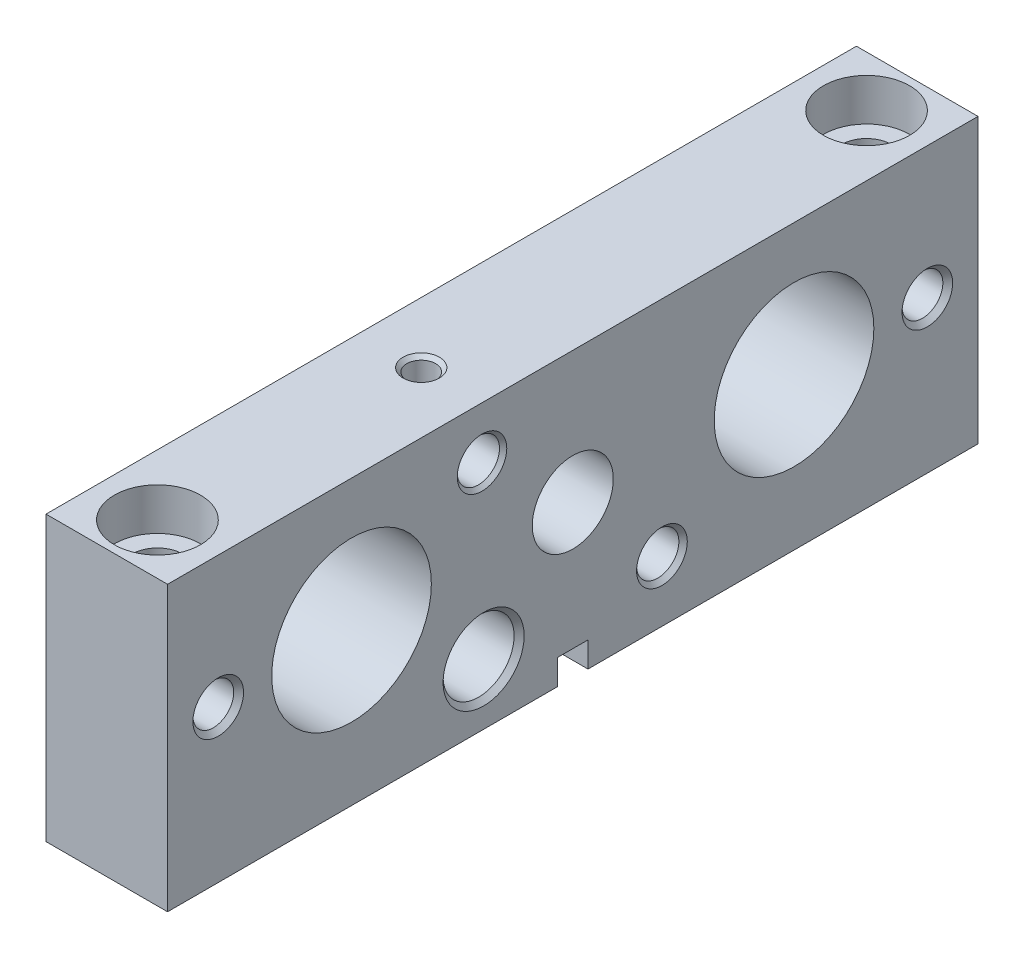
from build123d import *

# Parameters (mm, degrees)
EXTRUDE1_DEPTH     = 19.05
SKETCH2_R          = 2.38379
CUT_EXTRUDE1_DEPTH = 6.35
SKETCH9_W          = 19.05
SKETCH9_H          = 12.5095
SKETCH10_W         = 19.05
SKETCH10_H         = 12.5095


with BuildPart() as part:
    # Sketch1 → Extrude1 (new body)
    with BuildSketch(Plane(origin=(0, 0, 0), x_dir=(0, 0, -1), z_dir=(1, 0, 0))):
        Polygon((-63.5, -23.8252), (-2.38379, -23.8252), (-2.38379, -19.8628), (2.38379, -19.8628), (2.38379, -23.8252), (63.5, -23.8252), (63.5, 20.6248), (-63.5, 20.6248), align=None)
    extrude(amount=EXTRUDE1_DEPTH)

    # Sketch2 → Cut-Extrude1 (cut)
    with BuildSketch(Plane(origin=(0, -19.8628, 0), x_dir=(-1, 0, 0), z_dir=(0, 1, 0))):
        with Locations(Location((-9.525, 0, 0), (0, 0, 90))):
            Circle(SKETCH2_R)
    extrude(amount=CUT_EXTRUDE1_DEPTH, mode=Mode.SUBTRACT)

    # Sketch3 → Cut-Revolve1 (revolve, cut)
    with BuildSketch(Plane(origin=(0, -14.3002, 0), x_dir=(-1, 0, 0), z_dir=(0, 1, 0)), mode=Mode.PRIVATE) as cut_revolve1_sk:
        Polygon((-19.05, -13.97), (-19.05, -9.9949), (-18.3896, -10.6553), (-0.6604, -10.6553), (0, -9.9949), (0, -13.97), align=None)
    revolve(cut_revolve1_sk.sketch.rotate(Axis((0, -14.3002, -13.97), (1, 0, 0)), 180), axis=Axis((0, -14.3002, -13.97), (1, 0, 0)), mode=Mode.SUBTRACT)

    # Sketch4 → Cut-Revolve2 (revolve, cut)
    with BuildSketch(Plane(origin=(0, -14.3002, 0), x_dir=(-1, 0, 0), z_dir=(0, 1, 0)), mode=Mode.PRIVATE) as cut_revolve2_sk:
        Polygon((-19.05, 13.97), (-19.05, 20.32), (-18.2626, 19.5326), (-0.7874, 19.5326), (0, 20.32), (0, 13.97), align=None)
    revolve(cut_revolve2_sk.sketch.rotate(Axis((0, -14.3002, 13.97), (1, 0, 0)), 180), axis=Axis((0, -14.3002, 13.97), (1, 0, 0)), mode=Mode.SUBTRACT)

    # Sketch5 → Cut-Revolve3 (revolve, cut)
    with BuildSketch(Plane(origin=(0, 12.4968, 0), x_dir=(-1, 0, 0), z_dir=(0, 1, 0)), mode=Mode.PRIVATE) as cut_revolve3_sk:
        Polygon((-19.05, 14.224), (-19.05, 18.104), (-18.4795, 17.5335), (-0.5705, 17.5335), (0, 18.104), (0, 14.224), align=None)
    revolve(cut_revolve3_sk.sketch.rotate(Axis((0, 12.4968, 14.224), (1, 0, 0)), 180), axis=Axis((0, 12.4968, 14.224), (1, 0, 0)), mode=Mode.SUBTRACT)

    # Sketch6 → Cut-Revolve4 (revolve, cut)
    with BuildSketch(Plane.XY.offset(-55.5625), mode=Mode.PRIVATE) as cut_revolve4_sk:
        Polygon((9.525, 20.6248), (16.27251, 20.6248), (16.27251, 14.0208), (13.49375, 14.0208), (13.49375, -23.8252), (9.525, -23.8252), align=None)
    revolve(cut_revolve4_sk.sketch.rotate(Axis((9.525, -23.8252, -55.5625), (0, 1, 0)), 270), axis=Axis((9.525, -23.8252, -55.5625), (0, 1, 0)), mode=Mode.SUBTRACT)

    # Sketch7 → Cut-Revolve5 (revolve, cut)
    with BuildSketch(Plane.XY.offset(55.5625), mode=Mode.PRIVATE) as cut_revolve5_sk:
        Polygon((9.525, 20.6248), (16.27251, 20.6248), (16.27251, 14.0208), (13.49375, 14.0208), (13.49375, -23.8252), (9.525, -23.8252), align=None)
    revolve(cut_revolve5_sk.sketch.rotate(Axis((9.525, -23.8252, 55.5625), (0, 1, 0)), 270), axis=Axis((9.525, -23.8252, 55.5625), (0, 1, 0)), mode=Mode.SUBTRACT)

    # Sketch8 → Cut-Revolve6 (revolve, cut)
    with BuildSketch(Plane.XY.offset(14.224), mode=Mode.PRIVATE) as cut_revolve6_sk:
        Polygon((9.525, 20.6248), (12.3698, 20.6248), (11.7856, 20.0406), (11.7856, 16.256), (9.525, 14.950841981), align=None)
    revolve(cut_revolve6_sk.sketch.rotate(Axis((9.525, 14.950841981, 14.224), (0, 1, 0)), 270), axis=Axis((9.525, 14.950841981, 14.224), (0, 1, 0)), mode=Mode.SUBTRACT)

    # Sketch9 → Cut-Revolve7 (revolve, cut)
    with BuildSketch(Plane(origin=(0, 0, 0), x_dir=(-1, 0, 0), z_dir=(0, 1, 0)), mode=Mode.PRIVATE) as cut_revolve7_sk:
        with Locations((-9.525, 40.92575)):
            Rectangle(SKETCH9_W, SKETCH9_H)
    revolve(cut_revolve7_sk.sketch.rotate(Axis((0, 0, 34.671), (1, 0, 0)), 180), axis=Axis((0, 0, 34.671), (1, 0, 0)), mode=Mode.SUBTRACT)

    # Sketch10 → Cut-Revolve8 (revolve, cut)
    with BuildSketch(Plane(origin=(0, 0, 0), x_dir=(-1, 0, 0), z_dir=(0, 1, 0)), mode=Mode.PRIVATE) as cut_revolve8_sk:
        with Locations((-9.525, -28.41625)):
            Rectangle(SKETCH10_W, SKETCH10_H)
    revolve(cut_revolve8_sk.sketch.rotate(Axis((0, 0, -34.671), (1, 0, 0)), 180), axis=Axis((0, 0, -34.671), (1, 0, 0)), mode=Mode.SUBTRACT)

    # Sketch11 → Cut-Revolve9 (revolve, cut)
    with BuildSketch(Plane(origin=(0, 0, 0), x_dir=(-1, 0, 0), z_dir=(0, 1, 0)), mode=Mode.PRIVATE) as cut_revolve9_sk:
        Polygon((0, 0), (0, -5.131765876), (-0.600424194, -4.531341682), (-9.525, -4.252434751), (-9.525, -6.35), (-19.05, -6.35), (-19.05, 0), align=None)
    revolve(cut_revolve9_sk.sketch.rotate(Axis((19.05, 0, 0), (-1, 0, 0)), 180), axis=Axis((19.05, 0, 0), (-1, 0, 0)), mode=Mode.SUBTRACT)

    # Sketch12 → Cut-Revolve10 (revolve, cut)
    with BuildSketch(Plane(origin=(0, 0, 0), x_dir=(-1, 0, 0), z_dir=(0, 1, 0)), mode=Mode.PRIVATE) as cut_revolve10_sk:
        Polygon((-19.05, -55.5625), (-19.05, -51.59375), (-18.28165, -52.3621), (-0.76835, -52.3621), (0, -51.59375), (0, -55.5625), align=None)
    revolve(cut_revolve10_sk.sketch.rotate(Axis((0, 0, -55.5625), (1, 0, 0)), 180), axis=Axis((0, 0, -55.5625), (1, 0, 0)), mode=Mode.SUBTRACT)

    # Sketch13 → Cut-Revolve11 (revolve, cut)
    with BuildSketch(Plane(origin=(0, 0, 0), x_dir=(-1, 0, 0), z_dir=(0, 1, 0)), mode=Mode.PRIVATE) as cut_revolve11_sk:
        Polygon((-19.05, 55.5625), (-19.05, 59.53125), (-18.28165, 58.7629), (-0.76835, 58.7629), (0, 59.53125), (0, 55.5625), align=None)
    revolve(cut_revolve11_sk.sketch.rotate(Axis((0, 0, 55.5625), (1, 0, 0)), 180), axis=Axis((0, 0, 55.5625), (1, 0, 0)), mode=Mode.SUBTRACT)


solid = part.part
